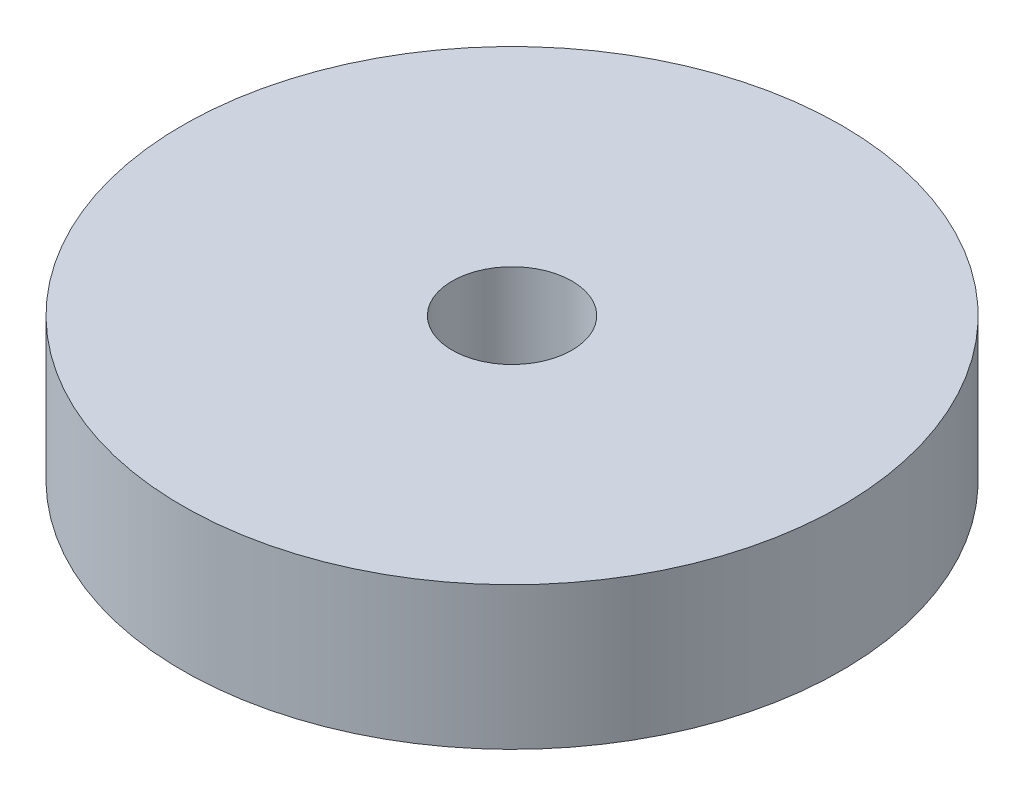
ISO-10303-21;
HEADER;
FILE_DESCRIPTION(('STEP AP214'),'2;1');
FILE_NAME('part.step','',(''),(''),'','','');
FILE_SCHEMA(('AUTOMOTIVE_DESIGN { 1 0 10303 214 1 1 1 1 }'));
ENDSEC;
DATA;
#1=APPLICATION_CONTEXT('core data for automotive mechanical design processes');
#2=APPLICATION_PROTOCOL_DEFINITION('international standard','automotive_design',2000,#1);
#3=PRODUCT_CONTEXT('',#1,'mechanical');
#4=PRODUCT('Part','Part','',(#3));
#5=PRODUCT_RELATED_PRODUCT_CATEGORY('part','',(#4));
#6=PRODUCT_DEFINITION_FORMATION('','',#4);
#7=PRODUCT_DEFINITION_CONTEXT('part definition',#1,'design');
#8=PRODUCT_DEFINITION('design','',#6,#7);
#9=PRODUCT_DEFINITION_SHAPE('','',#8);
#10=(LENGTH_UNIT() NAMED_UNIT(*) SI_UNIT(.MILLI.,.METRE.));
#11=(NAMED_UNIT(*) PLANE_ANGLE_UNIT() SI_UNIT($,.RADIAN.));
#12=(NAMED_UNIT(*) SI_UNIT($,.STERADIAN.) SOLID_ANGLE_UNIT());
#13=UNCERTAINTY_MEASURE_WITH_UNIT(LENGTH_MEASURE(1.E-05),#10,'distance_accuracy_value','');
#14=(GEOMETRIC_REPRESENTATION_CONTEXT(3) GLOBAL_UNCERTAINTY_ASSIGNED_CONTEXT((#13)) GLOBAL_UNIT_ASSIGNED_CONTEXT((#10,
#11,#12)) REPRESENTATION_CONTEXT('',''));
#15=CARTESIAN_POINT('',(0.,0.,0.));
#16=DIRECTION('',(0.,0.,1.));
#17=DIRECTION('',(1.,0.,0.));
#18=AXIS2_PLACEMENT_3D('',#15,#16,#17);
#19=CARTESIAN_POINT('',(0.,-3.175,0.));
#20=DIRECTION('',(0.,-1.,0.));
#21=DIRECTION('',(0.,0.,-1.));
#22=AXIS2_PLACEMENT_3D('',#19,#20,#21);
#23=CYLINDRICAL_SURFACE('',#22,2.54);
#24=CARTESIAN_POINT('',(0.,0.,0.));
#25=DIRECTION('',(0.,-1.,0.));
#26=DIRECTION('',(0.,0.,-1.));
#27=AXIS2_PLACEMENT_3D('',#24,#25,#26);
#28=CIRCLE('',#27,2.54);
#29=CARTESIAN_POINT('',(0.,0.,-2.54));
#30=VERTEX_POINT('',#29);
#31=EDGE_CURVE('E10',#30,#30,#28,.T.);
#32=ORIENTED_EDGE('',*,*,#31,.F.);
#33=EDGE_LOOP('',(#32));
#34=FACE_BOUND('',#33,.T.);
#35=CARTESIAN_POINT('',(0.,-6.0452,0.));
#36=DIRECTION('',(0.,-1.,0.));
#37=DIRECTION('',(0.,0.,-1.));
#38=AXIS2_PLACEMENT_3D('',#35,#36,#37);
#39=CIRCLE('',#38,2.54);
#40=CARTESIAN_POINT('',(0.,-6.0452,-2.54));
#41=VERTEX_POINT('',#40);
#42=EDGE_CURVE('E44',#41,#41,#39,.T.);
#43=ORIENTED_EDGE('',*,*,#42,.T.);
#44=EDGE_LOOP('',(#43));
#45=FACE_BOUND('',#44,.T.);
#46=ADVANCED_FACE('F30',(#34,#45),#23,.F.);
#47=CARTESIAN_POINT('',(0.,0.,-2.54));
#48=DIRECTION('',(0.,-1.,0.));
#49=DIRECTION('',(0.,0.,-1.));
#50=AXIS2_PLACEMENT_3D('',#47,#48,#49);
#51=PLANE('',#50);
#52=CARTESIAN_POINT('',(0.,0.,0.));
#53=DIRECTION('',(0.,-1.,0.));
#54=DIRECTION('',(0.,0.,-1.));
#55=AXIS2_PLACEMENT_3D('',#52,#53,#54);
#56=CIRCLE('',#55,13.97);
#57=CARTESIAN_POINT('',(0.,0.,-13.97));
#58=VERTEX_POINT('',#57);
#59=EDGE_CURVE('E36',#58,#58,#56,.T.);
#60=ORIENTED_EDGE('',*,*,#59,.F.);
#61=EDGE_LOOP('',(#60));
#62=FACE_BOUND('',#61,.T.);
#63=ORIENTED_EDGE('',*,*,#31,.T.);
#64=EDGE_LOOP('',(#63));
#65=FACE_BOUND('',#64,.T.);
#66=ADVANCED_FACE('F59',(#62,#65),#51,.F.);
#67=CARTESIAN_POINT('',(0.,-3.175,0.));
#68=DIRECTION('',(0.,-1.,0.));
#69=DIRECTION('',(0.,0.,-1.));
#70=AXIS2_PLACEMENT_3D('',#67,#68,#69);
#71=CYLINDRICAL_SURFACE('',#70,13.97);
#72=CARTESIAN_POINT('',(0.,-6.0452,0.));
#73=DIRECTION('',(0.,-1.,0.));
#74=DIRECTION('',(0.,0.,-1.));
#75=AXIS2_PLACEMENT_3D('',#72,#73,#74);
#76=CIRCLE('',#75,13.97);
#77=CARTESIAN_POINT('',(0.,-6.0452,-13.97));
#78=VERTEX_POINT('',#77);
#79=EDGE_CURVE('E40',#78,#78,#76,.T.);
#80=ORIENTED_EDGE('',*,*,#79,.F.);
#81=EDGE_LOOP('',(#80));
#82=FACE_BOUND('',#81,.T.);
#83=ORIENTED_EDGE('',*,*,#59,.T.);
#84=EDGE_LOOP('',(#83));
#85=FACE_BOUND('',#84,.T.);
#86=ADVANCED_FACE('F54',(#82,#85),#71,.T.);
#87=CARTESIAN_POINT('',(0.,-6.0452,-13.97));
#88=DIRECTION('',(0.,1.,0.));
#89=DIRECTION('',(0.,0.,1.));
#90=AXIS2_PLACEMENT_3D('',#87,#88,#89);
#91=PLANE('',#90);
#92=ORIENTED_EDGE('',*,*,#42,.F.);
#93=EDGE_LOOP('',(#92));
#94=FACE_BOUND('',#93,.T.);
#95=ORIENTED_EDGE('',*,*,#79,.T.);
#96=EDGE_LOOP('',(#95));
#97=FACE_BOUND('',#96,.T.);
#98=ADVANCED_FACE('F51',(#94,#97),#91,.F.);
#99=CLOSED_SHELL('',(#46,#66,#86,#98));
#100=MANIFOLD_SOLID_BREP('B2',#99);
#101=ADVANCED_BREP_SHAPE_REPRESENTATION('',(#18,#100),#14);
#102=SHAPE_DEFINITION_REPRESENTATION(#9,#101);
ENDSEC;
END-ISO-10303-21;
